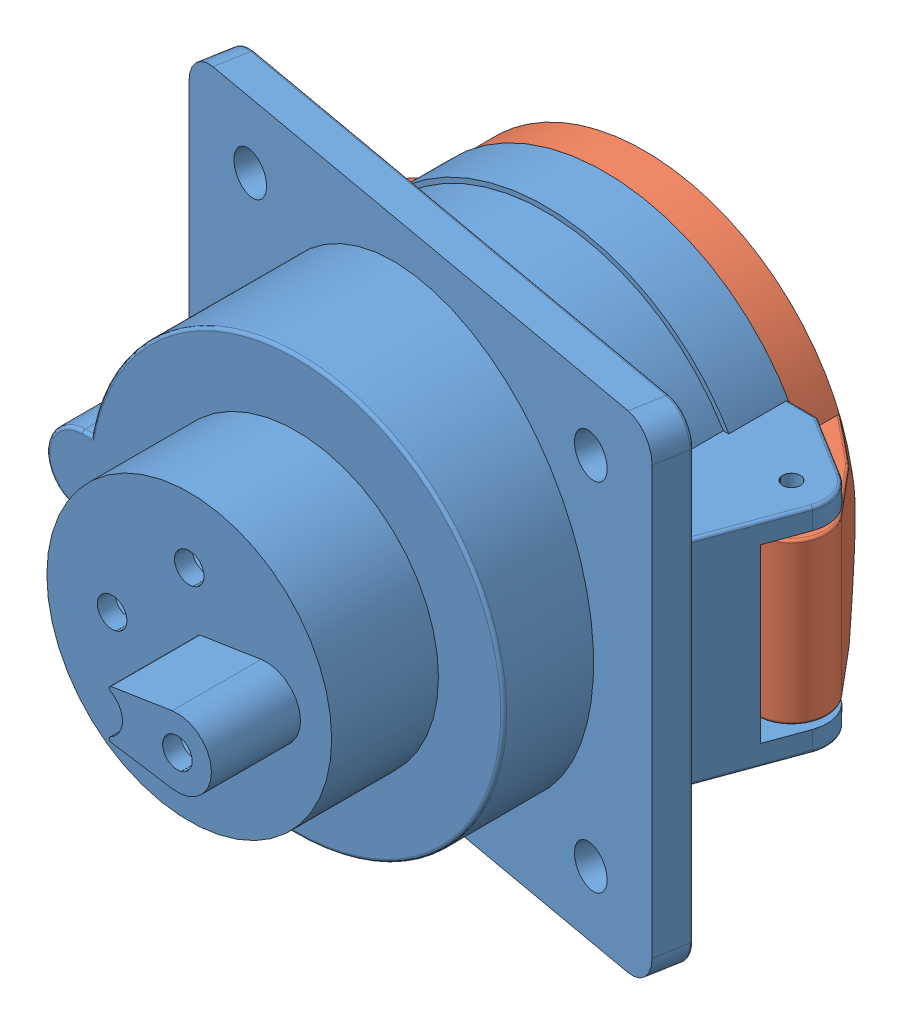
SolidWorks assembly Сборка 424-32.SLDASM, configuration По умолчанию (file format 10000). Lengths in mm.
Overall size (97.05 82 93.08).
2 component instances, 2 part files, 3 mates.
Components (placement in the parent):
- Корпус 424-1: Корпус 424.SLDPRT [По умолчанию] at (-2.5802 -2.3896 96.0264) size (97.05 82 85)
- Крышка 425, 424,-1: Крышка 425, 424,.SLDPRT [По умолчанию] at (-2.5802 -2.3896 46.0264) x (1 0 0) z (0 0 -1) size (91 71 25.59)
Mates (geometry in assembly coordinates):
- Концентричный1: concentric anti-aligned: cylinder of Корпус 424-1 through (-2.5802 -2.3896 54.0264) axis (0 0 -1) radius 35.8; cylinder of Крышка 425, 424,-1 through (-2.5802 -2.3896 38.5264) axis (0 0 1) radius 27.5
- Параллельность1: parallel aligned: plane of Корпус 424-1 through (-2.5802 38.6104 96.0264) normal (0 1 0); plane of Крышка 425, 424,-1 through (40.4198 11.1104 55.54) normal (0 1 0)
- Совпадение1: coincident anti-aligned: plane of Корпус 424-1 through (-2.5802 -2.3896 44.0264) normal (0 0 -1); plane of Крышка 425, 424,-1 through (-2.5802 -2.3896 44.0264) normal (0 0 1)
